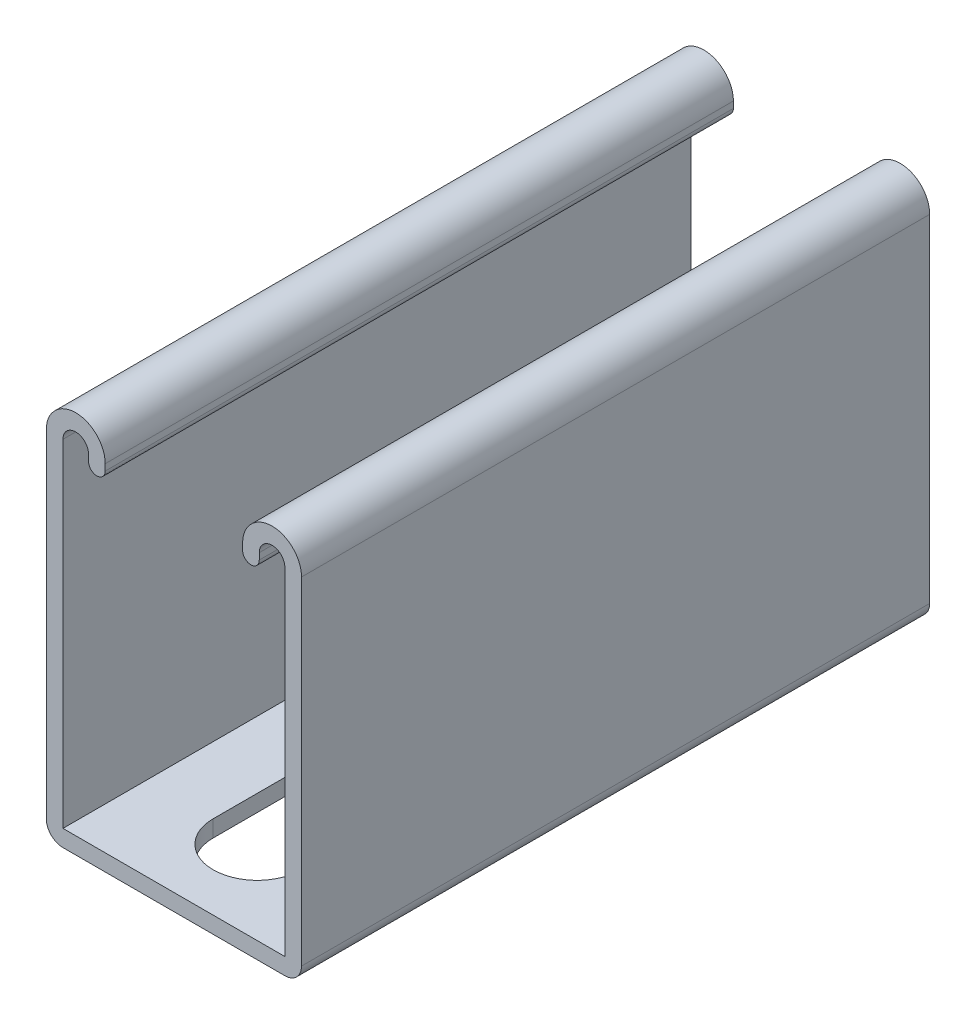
from build123d import *

# Parameters (mm, degrees)
BASE_EXTRUDE_DEPTH = 101.6
SLOT_DEPTH         = 130.648431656
LPATTERN1_COUNT    = 2
LPATTERN1_PITCH    = 50.8


with BuildPart() as part:
    # Sketch1 → Base-Extrude (new body)
    with BuildSketch(Plane.XY):
        with BuildLine():
            Line((-20.6375, 29.1719), (-20.6375, -25.3238))
            ThreePointArc((-20.6375, -25.3238), (-19.848914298, -27.227614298), (-17.9451, -28.0162))
            Line((-17.9451, -28.0162), (17.9451, -28.0162))
            ThreePointArc((17.9451, -28.0162), (19.848914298, -27.227614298), (20.6375, -25.3238))
            Line((20.6375, -25.3238), (20.6375, 29.1719))
            ThreePointArc((20.6375, 29.1719), (15.875, 33.9344), (11.1125, 29.1719))
            Line((11.1125, 29.1719), (11.1125, 28.13685))
            ThreePointArc((11.1125, 28.13685), (12.4587, 26.79065), (13.8049, 28.13685))
            Line((13.8049, 28.13685), (13.8049, 29.1719))
            ThreePointArc((13.8049, 29.1719), (15.875, 31.242), (17.9451, 29.1719))
            Line((17.9451, 29.1719), (17.9451, -25.3238))
            Line((17.9451, -25.3238), (-17.9451, -25.3238))
            Line((-17.9451, -25.3238), (-17.9451, 29.1719))
            ThreePointArc((-17.9451, 29.1719), (-15.875, 31.242), (-13.8049, 29.1719))
            Line((-13.8049, 29.1719), (-13.8049, 28.13685))
            ThreePointArc((-13.8049, 28.13685), (-12.4587, 26.79065), (-11.1125, 28.13685))
            Line((-11.1125, 28.13685), (-11.1125, 29.1719))
            ThreePointArc((-11.1125, 29.1719), (-15.875, 33.9344), (-20.6375, 29.1719))
        make_face()
    extrude(amount=BASE_EXTRUDE_DEPTH)

    # Sketch2 → Slot (cut, through all)
    with BuildSketch(Plane(origin=(-0.186902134, -28.0162, -10.369564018), x_dir=(1, 0, 0), z_dir=(0, -1, 0))):
        with BuildLine():
            Line((7.330652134, 47.675814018), (7.330652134, 33.388314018))
            ThreePointArc((7.330652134, 33.388314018), (0.186902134, 26.244564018), (-6.956847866, 33.388314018))
            Line((-6.956847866, 33.388314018), (-6.956847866, 47.675814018))
            ThreePointArc((-6.956847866, 47.675814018), (0.186902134, 54.819564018), (7.330652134, 47.675814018))
        make_face()
    slot = extrude(amount=-SLOT_DEPTH, mode=Mode.SUBTRACT)

    # LPattern1: Slot ×2
    with Locations(*[(0, 0, i * LPATTERN1_PITCH) for i in range(1, LPATTERN1_COUNT)]):
        add(slot, mode=Mode.SUBTRACT)


solid = part.part
